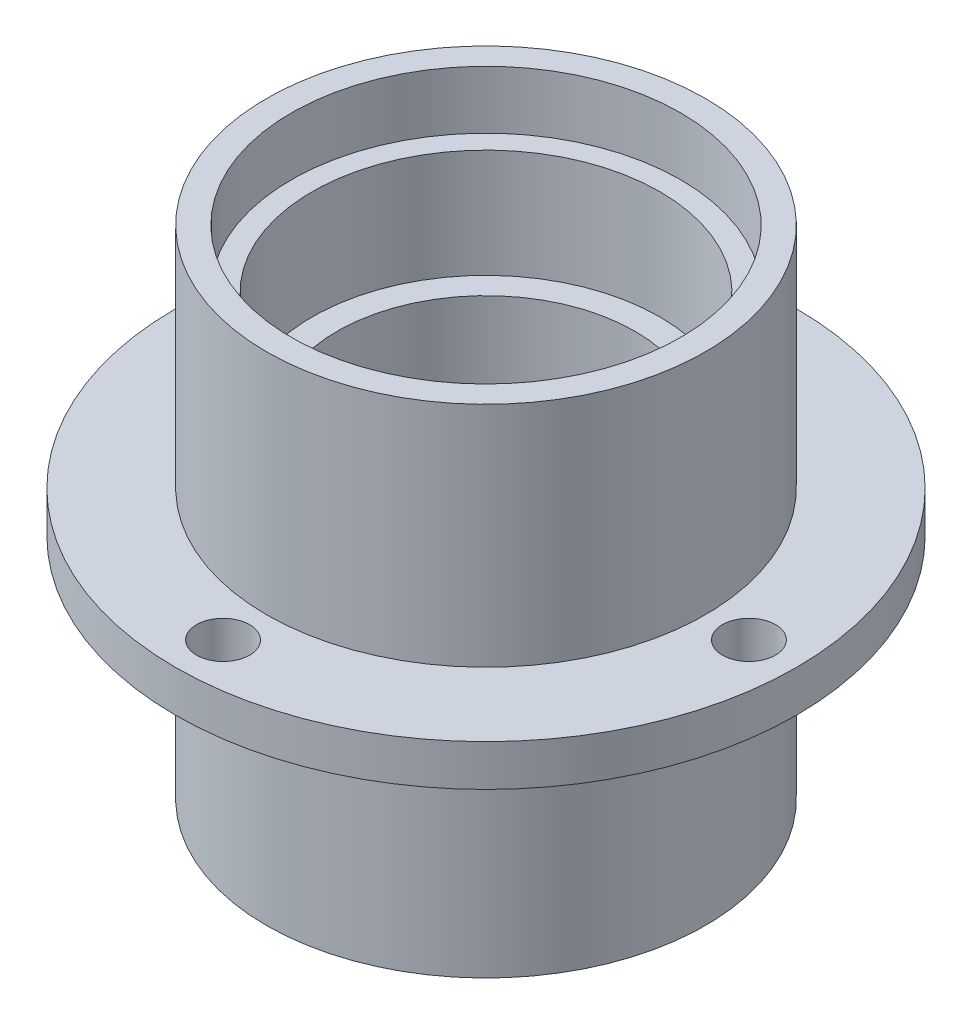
ISO-10303-21;
HEADER;
FILE_DESCRIPTION(('STEP AP214'),'2;1');
FILE_NAME('part.step','',(''),(''),'','','');
FILE_SCHEMA(('AUTOMOTIVE_DESIGN { 1 0 10303 214 1 1 1 1 }'));
ENDSEC;
DATA;
#1=APPLICATION_CONTEXT('core data for automotive mechanical design processes');
#2=APPLICATION_PROTOCOL_DEFINITION('international standard','automotive_design',2000,#1);
#3=PRODUCT_CONTEXT('',#1,'mechanical');
#4=PRODUCT('Part','Part','',(#3));
#5=PRODUCT_RELATED_PRODUCT_CATEGORY('part','',(#4));
#6=PRODUCT_DEFINITION_FORMATION('','',#4);
#7=PRODUCT_DEFINITION_CONTEXT('part definition',#1,'design');
#8=PRODUCT_DEFINITION('design','',#6,#7);
#9=PRODUCT_DEFINITION_SHAPE('','',#8);
#10=(LENGTH_UNIT() NAMED_UNIT(*) SI_UNIT(.MILLI.,.METRE.));
#11=(NAMED_UNIT(*) PLANE_ANGLE_UNIT() SI_UNIT($,.RADIAN.));
#12=(NAMED_UNIT(*) SI_UNIT($,.STERADIAN.) SOLID_ANGLE_UNIT());
#13=UNCERTAINTY_MEASURE_WITH_UNIT(LENGTH_MEASURE(1.E-05),#10,'distance_accuracy_value','');
#14=(GEOMETRIC_REPRESENTATION_CONTEXT(3) GLOBAL_UNCERTAINTY_ASSIGNED_CONTEXT((#13)) GLOBAL_UNIT_ASSIGNED_CONTEXT((#10,
#11,#12)) REPRESENTATION_CONTEXT('',''));
#15=CARTESIAN_POINT('',(0.,0.,0.));
#16=DIRECTION('',(0.,0.,1.));
#17=DIRECTION('',(1.,0.,0.));
#18=AXIS2_PLACEMENT_3D('',#15,#16,#17);
#19=CARTESIAN_POINT('',(0.,60.1,-26.5));
#20=DIRECTION('',(0.,1.,0.));
#21=DIRECTION('',(0.,0.,1.));
#22=AXIS2_PLACEMENT_3D('',#19,#20,#21);
#23=PLANE('',#22);
#24=CARTESIAN_POINT('',(0.,60.1,0.));
#25=DIRECTION('',(0.,-1.,0.));
#26=DIRECTION('',(0.,0.,-1.));
#27=AXIS2_PLACEMENT_3D('',#24,#25,#26);
#28=CIRCLE('',#27,23.5);
#29=CARTESIAN_POINT('',(0.,60.1,-23.5));
#30=VERTEX_POINT('',#29);
#31=EDGE_CURVE('E10',#30,#30,#28,.T.);
#32=ORIENTED_EDGE('',*,*,#31,.T.);
#33=EDGE_LOOP('',(#32));
#34=FACE_BOUND('',#33,.T.);
#35=CARTESIAN_POINT('',(0.,60.1,0.));
#36=DIRECTION('',(0.,-1.,0.));
#37=DIRECTION('',(0.,0.,-1.));
#38=AXIS2_PLACEMENT_3D('',#35,#36,#37);
#39=CIRCLE('',#38,26.5);
#40=CARTESIAN_POINT('',(0.,60.1,-26.5));
#41=VERTEX_POINT('',#40);
#42=EDGE_CURVE('E82',#41,#41,#39,.T.);
#43=ORIENTED_EDGE('',*,*,#42,.F.);
#44=EDGE_LOOP('',(#43));
#45=FACE_BOUND('',#44,.T.);
#46=ADVANCED_FACE('F30',(#34,#45),#23,.T.);
#47=CARTESIAN_POINT('',(0.,-13.2148221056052,0.));
#48=DIRECTION('',(0.,-1.,0.));
#49=DIRECTION('',(0.,0.,-1.));
#50=AXIS2_PLACEMENT_3D('',#47,#48,#49);
#51=CYLINDRICAL_SURFACE('',#50,23.5);
#52=CARTESIAN_POINT('',(0.,53.1,0.));
#53=DIRECTION('',(0.,-1.,0.));
#54=DIRECTION('',(0.,0.,-1.));
#55=AXIS2_PLACEMENT_3D('',#52,#53,#54);
#56=CIRCLE('',#55,23.5);
#57=CARTESIAN_POINT('',(0.,53.1,-23.5));
#58=VERTEX_POINT('',#57);
#59=EDGE_CURVE('E36',#58,#58,#56,.T.);
#60=ORIENTED_EDGE('',*,*,#59,.T.);
#61=EDGE_LOOP('',(#60));
#62=FACE_BOUND('',#61,.T.);
#63=ORIENTED_EDGE('',*,*,#31,.F.);
#64=EDGE_LOOP('',(#63));
#65=FACE_BOUND('',#64,.T.);
#66=ADVANCED_FACE('F197',(#62,#65),#51,.F.);
#67=CARTESIAN_POINT('',(0.,53.1,-23.5));
#68=DIRECTION('',(0.,1.,0.));
#69=DIRECTION('',(0.,0.,1.));
#70=AXIS2_PLACEMENT_3D('',#67,#68,#69);
#71=PLANE('',#70);
#72=CARTESIAN_POINT('',(0.,53.1,0.));
#73=DIRECTION('',(0.,-1.,0.));
#74=DIRECTION('',(0.,0.,-1.));
#75=AXIS2_PLACEMENT_3D('',#72,#73,#74);
#76=CIRCLE('',#75,21.);
#77=CARTESIAN_POINT('',(0.,53.1,-21.));
#78=VERTEX_POINT('',#77);
#79=EDGE_CURVE('E40',#78,#78,#76,.T.);
#80=ORIENTED_EDGE('',*,*,#79,.T.);
#81=EDGE_LOOP('',(#80));
#82=FACE_BOUND('',#81,.T.);
#83=ORIENTED_EDGE('',*,*,#59,.F.);
#84=EDGE_LOOP('',(#83));
#85=FACE_BOUND('',#84,.T.);
#86=ADVANCED_FACE('F191',(#82,#85),#71,.T.);
#87=CARTESIAN_POINT('',(0.,-13.2148221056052,0.));
#88=DIRECTION('',(0.,-1.,0.));
#89=DIRECTION('',(0.,0.,-1.));
#90=AXIS2_PLACEMENT_3D('',#87,#88,#89);
#91=CYLINDRICAL_SURFACE('',#90,21.);
#92=CARTESIAN_POINT('',(0.,40.,0.));
#93=DIRECTION('',(0.,-1.,0.));
#94=DIRECTION('',(0.,0.,-1.));
#95=AXIS2_PLACEMENT_3D('',#92,#93,#94);
#96=CIRCLE('',#95,21.);
#97=CARTESIAN_POINT('',(0.,40.,-21.));
#98=VERTEX_POINT('',#97);
#99=EDGE_CURVE('E44',#98,#98,#96,.T.);
#100=ORIENTED_EDGE('',*,*,#99,.T.);
#101=EDGE_LOOP('',(#100));
#102=FACE_BOUND('',#101,.T.);
#103=ORIENTED_EDGE('',*,*,#79,.F.);
#104=EDGE_LOOP('',(#103));
#105=FACE_BOUND('',#104,.T.);
#106=ADVANCED_FACE('F185',(#102,#105),#91,.F.);
#107=CARTESIAN_POINT('',(0.,40.,-21.));
#108=DIRECTION('',(0.,1.,0.));
#109=DIRECTION('',(0.,0.,1.));
#110=AXIS2_PLACEMENT_3D('',#107,#108,#109);
#111=PLANE('',#110);
#112=CARTESIAN_POINT('',(0.,40.,0.));
#113=DIRECTION('',(0.,-1.,0.));
#114=DIRECTION('',(0.,0.,-1.));
#115=AXIS2_PLACEMENT_3D('',#112,#113,#114);
#116=CIRCLE('',#115,18.);
#117=CARTESIAN_POINT('',(0.,40.,-18.));
#118=VERTEX_POINT('',#117);
#119=EDGE_CURVE('E49',#118,#118,#116,.T.);
#120=ORIENTED_EDGE('',*,*,#119,.T.);
#121=EDGE_LOOP('',(#120));
#122=FACE_BOUND('',#121,.T.);
#123=ORIENTED_EDGE('',*,*,#99,.F.);
#124=EDGE_LOOP('',(#123));
#125=FACE_BOUND('',#124,.T.);
#126=ADVANCED_FACE('F179',(#122,#125),#111,.T.);
#127=CARTESIAN_POINT('',(0.,-13.2148221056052,0.));
#128=DIRECTION('',(0.,-1.,0.));
#129=DIRECTION('',(0.,0.,-1.));
#130=AXIS2_PLACEMENT_3D('',#127,#128,#129);
#131=CYLINDRICAL_SURFACE('',#130,18.);
#132=CARTESIAN_POINT('',(0.,20.,0.));
#133=DIRECTION('',(0.,-1.,0.));
#134=DIRECTION('',(0.,0.,-1.));
#135=AXIS2_PLACEMENT_3D('',#132,#133,#134);
#136=CIRCLE('',#135,18.);
#137=CARTESIAN_POINT('',(0.,20.,-18.));
#138=VERTEX_POINT('',#137);
#139=EDGE_CURVE('E52',#138,#138,#136,.T.);
#140=ORIENTED_EDGE('',*,*,#139,.T.);
#141=EDGE_LOOP('',(#140));
#142=FACE_BOUND('',#141,.T.);
#143=ORIENTED_EDGE('',*,*,#119,.F.);
#144=EDGE_LOOP('',(#143));
#145=FACE_BOUND('',#144,.T.);
#146=ADVANCED_FACE('F173',(#142,#145),#131,.F.);
#147=CARTESIAN_POINT('',(0.,20.,-18.));
#148=DIRECTION('',(0.,-1.,0.));
#149=DIRECTION('',(0.,0.,-1.));
#150=AXIS2_PLACEMENT_3D('',#147,#148,#149);
#151=PLANE('',#150);
#152=CARTESIAN_POINT('',(0.,20.,0.));
#153=DIRECTION('',(0.,-1.,0.));
#154=DIRECTION('',(0.,0.,-1.));
#155=AXIS2_PLACEMENT_3D('',#152,#153,#154);
#156=CIRCLE('',#155,21.);
#157=CARTESIAN_POINT('',(0.,20.,-21.));
#158=VERTEX_POINT('',#157);
#159=EDGE_CURVE('E55',#158,#158,#156,.T.);
#160=ORIENTED_EDGE('',*,*,#159,.T.);
#161=EDGE_LOOP('',(#160));
#162=FACE_BOUND('',#161,.T.);
#163=ORIENTED_EDGE('',*,*,#139,.F.);
#164=EDGE_LOOP('',(#163));
#165=FACE_BOUND('',#164,.T.);
#166=ADVANCED_FACE('F167',(#162,#165),#151,.T.);
#167=CARTESIAN_POINT('',(0.,-13.2148221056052,0.));
#168=DIRECTION('',(0.,-1.,0.));
#169=DIRECTION('',(0.,0.,-1.));
#170=AXIS2_PLACEMENT_3D('',#167,#168,#169);
#171=CYLINDRICAL_SURFACE('',#170,21.);
#172=CARTESIAN_POINT('',(0.,6.99999999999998,0.));
#173=DIRECTION('',(0.,-1.,0.));
#174=DIRECTION('',(0.,0.,-1.));
#175=AXIS2_PLACEMENT_3D('',#172,#173,#174);
#176=CIRCLE('',#175,21.);
#177=CARTESIAN_POINT('',(0.,6.99999999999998,-21.));
#178=VERTEX_POINT('',#177);
#179=EDGE_CURVE('E58',#178,#178,#176,.T.);
#180=ORIENTED_EDGE('',*,*,#179,.T.);
#181=EDGE_LOOP('',(#180));
#182=FACE_BOUND('',#181,.T.);
#183=ORIENTED_EDGE('',*,*,#159,.F.);
#184=EDGE_LOOP('',(#183));
#185=FACE_BOUND('',#184,.T.);
#186=ADVANCED_FACE('F161',(#182,#185),#171,.F.);
#187=CARTESIAN_POINT('',(0.,6.99999999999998,-21.));
#188=DIRECTION('',(0.,-1.,0.));
#189=DIRECTION('',(0.,0.,-1.));
#190=AXIS2_PLACEMENT_3D('',#187,#188,#189);
#191=PLANE('',#190);
#192=CARTESIAN_POINT('',(0.,6.99999999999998,0.));
#193=DIRECTION('',(0.,-1.,0.));
#194=DIRECTION('',(0.,0.,-1.));
#195=AXIS2_PLACEMENT_3D('',#192,#193,#194);
#196=CIRCLE('',#195,23.5);
#197=CARTESIAN_POINT('',(0.,6.99999999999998,-23.5));
#198=VERTEX_POINT('',#197);
#199=EDGE_CURVE('E61',#198,#198,#196,.T.);
#200=ORIENTED_EDGE('',*,*,#199,.T.);
#201=EDGE_LOOP('',(#200));
#202=FACE_BOUND('',#201,.T.);
#203=ORIENTED_EDGE('',*,*,#179,.F.);
#204=EDGE_LOOP('',(#203));
#205=FACE_BOUND('',#204,.T.);
#206=ADVANCED_FACE('F155',(#202,#205),#191,.T.);
#207=CARTESIAN_POINT('',(0.,-13.2148221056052,0.));
#208=DIRECTION('',(0.,-1.,0.));
#209=DIRECTION('',(0.,0.,-1.));
#210=AXIS2_PLACEMENT_3D('',#207,#208,#209);
#211=CYLINDRICAL_SURFACE('',#210,23.5);
#212=CARTESIAN_POINT('',(0.,0.,0.));
#213=DIRECTION('',(0.,-1.,0.));
#214=DIRECTION('',(0.,0.,-1.));
#215=AXIS2_PLACEMENT_3D('',#212,#213,#214);
#216=CIRCLE('',#215,23.5);
#217=CARTESIAN_POINT('',(0.,0.,-23.5));
#218=VERTEX_POINT('',#217);
#219=EDGE_CURVE('E64',#218,#218,#216,.T.);
#220=ORIENTED_EDGE('',*,*,#219,.T.);
#221=EDGE_LOOP('',(#220));
#222=FACE_BOUND('',#221,.T.);
#223=ORIENTED_EDGE('',*,*,#199,.F.);
#224=EDGE_LOOP('',(#223));
#225=FACE_BOUND('',#224,.T.);
#226=ADVANCED_FACE('F149',(#222,#225),#211,.F.);
#227=CARTESIAN_POINT('',(0.,0.,0.));
#228=DIRECTION('',(0.,1.,0.));
#229=DIRECTION('',(0.,0.,1.));
#230=AXIS2_PLACEMENT_3D('',#227,#228,#229);
#231=CONICAL_SURFACE('',#230,23.5,1.53747533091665);
#232=CARTESIAN_POINT('',(0.,0.0999999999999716,0.));
#233=DIRECTION('',(0.,-1.,0.));
#234=DIRECTION('',(0.,0.,-1.));
#235=AXIS2_PLACEMENT_3D('',#232,#233,#234);
#236=CIRCLE('',#235,26.5);
#237=CARTESIAN_POINT('',(0.,0.0999999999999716,-26.5));
#238=VERTEX_POINT('',#237);
#239=EDGE_CURVE('E67',#238,#238,#236,.T.);
#240=ORIENTED_EDGE('',*,*,#239,.T.);
#241=EDGE_LOOP('',(#240));
#242=FACE_BOUND('',#241,.T.);
#243=ORIENTED_EDGE('',*,*,#219,.F.);
#244=EDGE_LOOP('',(#243));
#245=FACE_BOUND('',#244,.T.);
#246=ADVANCED_FACE('F143',(#242,#245),#231,.T.);
#247=CARTESIAN_POINT('',(0.,-13.2148221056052,0.));
#248=DIRECTION('',(0.,-1.,0.));
#249=DIRECTION('',(0.,0.,-1.));
#250=AXIS2_PLACEMENT_3D('',#247,#248,#249);
#251=CYLINDRICAL_SURFACE('',#250,26.5);
#252=CARTESIAN_POINT('',(0.,27.6,0.));
#253=DIRECTION('',(0.,-1.,0.));
#254=DIRECTION('',(0.,0.,-1.));
#255=AXIS2_PLACEMENT_3D('',#252,#253,#254);
#256=CIRCLE('',#255,26.5);
#257=CARTESIAN_POINT('',(0.,27.6,-26.5));
#258=VERTEX_POINT('',#257);
#259=EDGE_CURVE('E70',#258,#258,#256,.T.);
#260=ORIENTED_EDGE('',*,*,#259,.T.);
#261=EDGE_LOOP('',(#260));
#262=FACE_BOUND('',#261,.T.);
#263=ORIENTED_EDGE('',*,*,#239,.F.);
#264=EDGE_LOOP('',(#263));
#265=FACE_BOUND('',#264,.T.);
#266=ADVANCED_FACE('F136',(#262,#265),#251,.T.);
#267=CARTESIAN_POINT('',(0.,27.6,-26.5));
#268=DIRECTION('',(0.,-1.,0.));
#269=DIRECTION('',(0.,0.,-1.));
#270=AXIS2_PLACEMENT_3D('',#267,#268,#269);
#271=PLANE('',#270);
#272=CARTESIAN_POINT('',(0.,27.6,-31.75));
#273=DIRECTION('',(0.,-1.,0.));
#274=DIRECTION('',(0.,0.,-1.));
#275=AXIS2_PLACEMENT_3D('',#272,#273,#274);
#276=CIRCLE('',#275,3.2);
#277=CARTESIAN_POINT('',(0.,27.6,-34.95));
#278=VERTEX_POINT('',#277);
#279=EDGE_CURVE('E103',#278,#278,#276,.T.);
#280=ORIENTED_EDGE('',*,*,#279,.F.);
#281=EDGE_LOOP('',(#280));
#282=FACE_BOUND('',#281,.T.);
#283=CARTESIAN_POINT('',(-31.75,27.6,0.));
#284=DIRECTION('',(0.,-1.,0.));
#285=DIRECTION('',(0.,0.,-1.));
#286=AXIS2_PLACEMENT_3D('',#283,#284,#285);
#287=CIRCLE('',#286,3.2);
#288=CARTESIAN_POINT('',(-31.75,27.6,-3.19999999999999));
#289=VERTEX_POINT('',#288);
#290=EDGE_CURVE('E97',#289,#289,#287,.T.);
#291=ORIENTED_EDGE('',*,*,#290,.F.);
#292=EDGE_LOOP('',(#291));
#293=FACE_BOUND('',#292,.T.);
#294=CARTESIAN_POINT('',(0.,27.6,31.75));
#295=DIRECTION('',(0.,-1.,0.));
#296=DIRECTION('',(0.,0.,-1.));
#297=AXIS2_PLACEMENT_3D('',#294,#295,#296);
#298=CIRCLE('',#297,3.2);
#299=CARTESIAN_POINT('',(0.,27.6,28.55));
#300=VERTEX_POINT('',#299);
#301=EDGE_CURVE('E91',#300,#300,#298,.T.);
#302=ORIENTED_EDGE('',*,*,#301,.F.);
#303=EDGE_LOOP('',(#302));
#304=FACE_BOUND('',#303,.T.);
#305=CARTESIAN_POINT('',(31.75,27.6,0.));
#306=DIRECTION('',(0.,-1.,0.));
#307=DIRECTION('',(0.,0.,-1.));
#308=AXIS2_PLACEMENT_3D('',#305,#306,#307);
#309=CIRCLE('',#308,3.2);
#310=CARTESIAN_POINT('',(31.75,27.6,-3.20000000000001));
#311=VERTEX_POINT('',#310);
#312=EDGE_CURVE('E85',#311,#311,#309,.T.);
#313=ORIENTED_EDGE('',*,*,#312,.F.);
#314=EDGE_LOOP('',(#313));
#315=FACE_BOUND('',#314,.T.);
#316=CARTESIAN_POINT('',(0.,27.6,0.));
#317=DIRECTION('',(0.,-1.,0.));
#318=DIRECTION('',(0.,0.,-1.));
#319=AXIS2_PLACEMENT_3D('',#316,#317,#318);
#320=CIRCLE('',#319,37.5);
#321=CARTESIAN_POINT('',(0.,27.6,-37.5));
#322=VERTEX_POINT('',#321);
#323=EDGE_CURVE('E73',#322,#322,#320,.T.);
#324=ORIENTED_EDGE('',*,*,#323,.T.);
#325=EDGE_LOOP('',(#324));
#326=FACE_BOUND('',#325,.T.);
#327=ORIENTED_EDGE('',*,*,#259,.F.);
#328=EDGE_LOOP('',(#327));
#329=FACE_BOUND('',#328,.T.);
#330=ADVANCED_FACE('F130',(#282,#293,#304,#315,#326,#329),#271,.T.);
#331=CARTESIAN_POINT('',(0.,-13.2148221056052,0.));
#332=DIRECTION('',(0.,-1.,0.));
#333=DIRECTION('',(0.,0.,-1.));
#334=AXIS2_PLACEMENT_3D('',#331,#332,#333);
#335=CYLINDRICAL_SURFACE('',#334,37.5);
#336=CARTESIAN_POINT('',(0.,32.6,0.));
#337=DIRECTION('',(0.,-1.,0.));
#338=DIRECTION('',(0.,0.,-1.));
#339=AXIS2_PLACEMENT_3D('',#336,#337,#338);
#340=CIRCLE('',#339,37.5);
#341=CARTESIAN_POINT('',(0.,32.6,-37.5));
#342=VERTEX_POINT('',#341);
#343=EDGE_CURVE('E76',#342,#342,#340,.T.);
#344=ORIENTED_EDGE('',*,*,#343,.T.);
#345=EDGE_LOOP('',(#344));
#346=FACE_BOUND('',#345,.T.);
#347=ORIENTED_EDGE('',*,*,#323,.F.);
#348=EDGE_LOOP('',(#347));
#349=FACE_BOUND('',#348,.T.);
#350=ADVANCED_FACE('F116',(#346,#349),#335,.T.);
#351=CARTESIAN_POINT('',(0.,32.6,-37.5));
#352=DIRECTION('',(0.,1.,0.));
#353=DIRECTION('',(0.,0.,1.));
#354=AXIS2_PLACEMENT_3D('',#351,#352,#353);
#355=PLANE('',#354);
#356=CARTESIAN_POINT('',(0.,32.6,-31.75));
#357=DIRECTION('',(0.,1.,0.));
#358=DIRECTION('',(0.,0.,1.));
#359=AXIS2_PLACEMENT_3D('',#356,#357,#358);
#360=CIRCLE('',#359,3.2);
#361=CARTESIAN_POINT('',(0.,32.6,-28.55));
#362=VERTEX_POINT('',#361);
#363=EDGE_CURVE('E106',#362,#362,#360,.T.);
#364=ORIENTED_EDGE('',*,*,#363,.F.);
#365=EDGE_LOOP('',(#364));
#366=FACE_BOUND('',#365,.T.);
#367=CARTESIAN_POINT('',(-31.75,32.6,0.));
#368=DIRECTION('',(0.,1.,0.));
#369=DIRECTION('',(0.,0.,1.));
#370=AXIS2_PLACEMENT_3D('',#367,#368,#369);
#371=CIRCLE('',#370,3.2);
#372=CARTESIAN_POINT('',(-31.75,32.6,3.20000000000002));
#373=VERTEX_POINT('',#372);
#374=EDGE_CURVE('E100',#373,#373,#371,.T.);
#375=ORIENTED_EDGE('',*,*,#374,.F.);
#376=EDGE_LOOP('',(#375));
#377=FACE_BOUND('',#376,.T.);
#378=CARTESIAN_POINT('',(0.,32.6,31.75));
#379=DIRECTION('',(0.,1.,0.));
#380=DIRECTION('',(0.,0.,1.));
#381=AXIS2_PLACEMENT_3D('',#378,#379,#380);
#382=CIRCLE('',#381,3.2);
#383=CARTESIAN_POINT('',(0.,32.6,34.95));
#384=VERTEX_POINT('',#383);
#385=EDGE_CURVE('E94',#384,#384,#382,.T.);
#386=ORIENTED_EDGE('',*,*,#385,.F.);
#387=EDGE_LOOP('',(#386));
#388=FACE_BOUND('',#387,.T.);
#389=CARTESIAN_POINT('',(31.75,32.6,0.));
#390=DIRECTION('',(0.,1.,0.));
#391=DIRECTION('',(0.,0.,1.));
#392=AXIS2_PLACEMENT_3D('',#389,#390,#391);
#393=CIRCLE('',#392,3.2);
#394=CARTESIAN_POINT('',(31.75,32.6,3.19999999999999));
#395=VERTEX_POINT('',#394);
#396=EDGE_CURVE('E88',#395,#395,#393,.T.);
#397=ORIENTED_EDGE('',*,*,#396,.F.);
#398=EDGE_LOOP('',(#397));
#399=FACE_BOUND('',#398,.T.);
#400=CARTESIAN_POINT('',(0.,32.6,0.));
#401=DIRECTION('',(0.,-1.,0.));
#402=DIRECTION('',(0.,0.,-1.));
#403=AXIS2_PLACEMENT_3D('',#400,#401,#402);
#404=CIRCLE('',#403,26.5);
#405=CARTESIAN_POINT('',(0.,32.6,-26.5));
#406=VERTEX_POINT('',#405);
#407=EDGE_CURVE('E79',#406,#406,#404,.T.);
#408=ORIENTED_EDGE('',*,*,#407,.T.);
#409=EDGE_LOOP('',(#408));
#410=FACE_BOUND('',#409,.T.);
#411=ORIENTED_EDGE('',*,*,#343,.F.);
#412=EDGE_LOOP('',(#411));
#413=FACE_BOUND('',#412,.T.);
#414=ADVANCED_FACE('F112',(#366,#377,#388,#399,#410,#413),#355,.T.);
#415=CARTESIAN_POINT('',(0.,-13.2148221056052,0.));
#416=DIRECTION('',(0.,-1.,0.));
#417=DIRECTION('',(0.,0.,-1.));
#418=AXIS2_PLACEMENT_3D('',#415,#416,#417);
#419=CYLINDRICAL_SURFACE('',#418,26.5);
#420=ORIENTED_EDGE('',*,*,#42,.T.);
#421=EDGE_LOOP('',(#420));
#422=FACE_BOUND('',#421,.T.);
#423=ORIENTED_EDGE('',*,*,#407,.F.);
#424=EDGE_LOOP('',(#423));
#425=FACE_BOUND('',#424,.T.);
#426=ADVANCED_FACE('F115',(#422,#425),#419,.T.);
#427=CARTESIAN_POINT('',(31.75,22.6,0.));
#428=DIRECTION('',(0.,1.,0.));
#429=DIRECTION('',(0.,0.,1.));
#430=AXIS2_PLACEMENT_3D('',#427,#428,#429);
#431=CYLINDRICAL_SURFACE('',#430,3.2);
#432=ORIENTED_EDGE('',*,*,#312,.T.);
#433=EDGE_LOOP('',(#432));
#434=FACE_BOUND('',#433,.T.);
#435=ORIENTED_EDGE('',*,*,#396,.T.);
#436=EDGE_LOOP('',(#435));
#437=FACE_BOUND('',#436,.T.);
#438=ADVANCED_FACE('F210',(#434,#437),#431,.F.);
#439=CARTESIAN_POINT('',(0.,22.6,31.75));
#440=DIRECTION('',(0.,1.,0.));
#441=DIRECTION('',(0.,0.,1.));
#442=AXIS2_PLACEMENT_3D('',#439,#440,#441);
#443=CYLINDRICAL_SURFACE('',#442,3.2);
#444=ORIENTED_EDGE('',*,*,#301,.T.);
#445=EDGE_LOOP('',(#444));
#446=FACE_BOUND('',#445,.T.);
#447=ORIENTED_EDGE('',*,*,#385,.T.);
#448=EDGE_LOOP('',(#447));
#449=FACE_BOUND('',#448,.T.);
#450=ADVANCED_FACE('F215',(#446,#449),#443,.F.);
#451=CARTESIAN_POINT('',(-31.75,22.6,0.));
#452=DIRECTION('',(0.,1.,0.));
#453=DIRECTION('',(0.,0.,1.));
#454=AXIS2_PLACEMENT_3D('',#451,#452,#453);
#455=CYLINDRICAL_SURFACE('',#454,3.2);
#456=ORIENTED_EDGE('',*,*,#290,.T.);
#457=EDGE_LOOP('',(#456));
#458=FACE_BOUND('',#457,.T.);
#459=ORIENTED_EDGE('',*,*,#374,.T.);
#460=EDGE_LOOP('',(#459));
#461=FACE_BOUND('',#460,.T.);
#462=ADVANCED_FACE('F221',(#458,#461),#455,.F.);
#463=CARTESIAN_POINT('',(0.,22.6,-31.75));
#464=DIRECTION('',(0.,1.,0.));
#465=DIRECTION('',(0.,0.,1.));
#466=AXIS2_PLACEMENT_3D('',#463,#464,#465);
#467=CYLINDRICAL_SURFACE('',#466,3.2);
#468=ORIENTED_EDGE('',*,*,#279,.T.);
#469=EDGE_LOOP('',(#468));
#470=FACE_BOUND('',#469,.T.);
#471=ORIENTED_EDGE('',*,*,#363,.T.);
#472=EDGE_LOOP('',(#471));
#473=FACE_BOUND('',#472,.T.);
#474=ADVANCED_FACE('F110',(#470,#473),#467,.F.);
#475=CLOSED_SHELL('',(#46,#66,#86,#106,#126,#146,#166,#186,#206,#226,#246,#266,#330,#350,#414,
#426,#438,#450,#462,#474));
#476=MANIFOLD_SOLID_BREP('B2',#475);
#477=ADVANCED_BREP_SHAPE_REPRESENTATION('',(#18,#476),#14);
#478=SHAPE_DEFINITION_REPRESENTATION(#9,#477);
ENDSEC;
END-ISO-10303-21;
